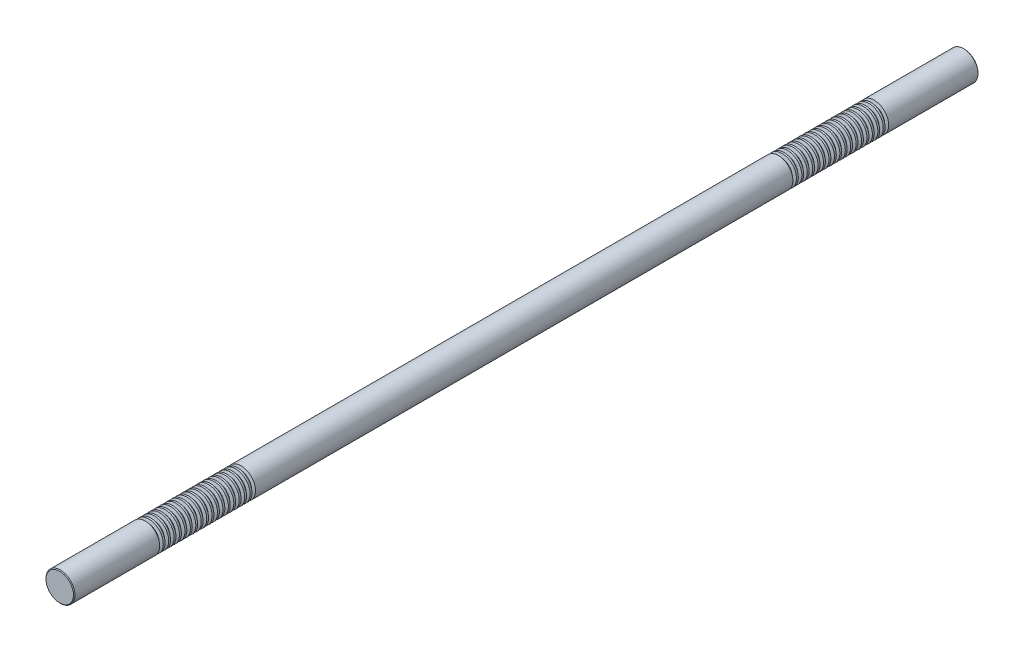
from build123d import *

# Parameters (mm, degrees)
SKETCH1_R           = 16
BOSS_EXTRUDE1_DEPTH = 500
CHAMFER1_SIZE       = 0.8
LPATTERN1_COUNT     = 18
LPATTERN1_PITCH     = 6
LPATTERN2_COUNT     = 2
LPATTERN2_PITCH     = 700


with BuildPart() as part:
    # Sketch1 → Boss-Extrude1 (new, symmetric)
    with BuildSketch(Plane.XY):
        Circle(SKETCH1_R)
    extrude(amount=BOSS_EXTRUDE1_DEPTH, both=True)

    # Chamfer1
    chamfer1_edges = [part.edges().sort_by_distance(p)[0] for p in [
        (-16, 0, -500),
        (-16, 0, 500),
    ]]
    chamfer(chamfer1_edges, length=CHAMFER1_SIZE)

    # Sketch2 → Cut-Revolve1 (revolve, cut)
    with BuildSketch(Plane(origin=(0, 0, 0), x_dir=(0, 0, -1), z_dir=(1, 0, 0)), mode=Mode.PRIVATE) as cut_revolve1_sk:
        Polygon((400.468911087, 16), (396.531088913, 16), (397.468911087, 12.5), (399.531088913, 12.5), align=None)
    cut_revolve1 = revolve(cut_revolve1_sk.sketch.rotate(Axis((0, 0, 500), (0, 0, -1)), 90), axis=Axis((0, 0, 500), (0, 0, -1)), mode=Mode.SUBTRACT)

    # LPattern1: Cut-Revolve1 ×18
    with Locations(*[(0, 0, i * LPATTERN1_PITCH) for i in range(1, LPATTERN1_COUNT)]):
        add(cut_revolve1, mode=Mode.SUBTRACT)

    # LPattern2: Cut-Revolve1 ×2
    with Locations(*[(0, 0, i * LPATTERN2_PITCH) for i in range(1, LPATTERN2_COUNT)]):
        add(cut_revolve1, mode=Mode.SUBTRACT)

    # LPattern2 copy 1 sketch → LPattern2 copy 1 (revolve, cut)
    with BuildSketch(Plane(origin=(0, 0, 706), x_dir=(0, 0, -1), z_dir=(1, 0, 0))):
        Polygon((400.468911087, 16), (396.531088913, 16), (397.468911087, 12.5), (399.531088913, 12.5), align=None)
    revolve(axis=Axis((0, 0, 1206), (0, 0, -1)), mode=Mode.SUBTRACT)

    # LPattern2 copy 2 sketch → LPattern2 copy 2 (revolve, cut)
    with BuildSketch(Plane(origin=(0, 0, 712), x_dir=(0, 0, -1), z_dir=(1, 0, 0))):
        Polygon((400.468911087, 16), (396.531088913, 16), (397.468911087, 12.5), (399.531088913, 12.5), align=None)
    revolve(axis=Axis((0, 0, 1212), (0, 0, -1)), mode=Mode.SUBTRACT)

    # LPattern2 copy 3 sketch → LPattern2 copy 3 (revolve, cut)
    with BuildSketch(Plane(origin=(0, 0, 718), x_dir=(0, 0, -1), z_dir=(1, 0, 0))):
        Polygon((400.468911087, 16), (396.531088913, 16), (397.468911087, 12.5), (399.531088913, 12.5), align=None)
    revolve(axis=Axis((0, 0, 1218), (0, 0, -1)), mode=Mode.SUBTRACT)

    # LPattern2 copy 4 sketch → LPattern2 copy 4 (revolve, cut)
    with BuildSketch(Plane(origin=(0, 0, 724), x_dir=(0, 0, -1), z_dir=(1, 0, 0))):
        Polygon((400.468911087, 16), (396.531088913, 16), (397.468911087, 12.5), (399.531088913, 12.5), align=None)
    revolve(axis=Axis((0, 0, 1224), (0, 0, -1)), mode=Mode.SUBTRACT)

    # LPattern2 copy 5 sketch → LPattern2 copy 5 (revolve, cut)
    with BuildSketch(Plane(origin=(0, 0, 730), x_dir=(0, 0, -1), z_dir=(1, 0, 0))):
        Polygon((400.468911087, 16), (396.531088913, 16), (397.468911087, 12.5), (399.531088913, 12.5), align=None)
    revolve(axis=Axis((0, 0, 1230), (0, 0, -1)), mode=Mode.SUBTRACT)

    # LPattern2 copy 6 sketch → LPattern2 copy 6 (revolve, cut)
    with BuildSketch(Plane(origin=(0, 0, 736), x_dir=(0, 0, -1), z_dir=(1, 0, 0))):
        Polygon((400.468911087, 16), (396.531088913, 16), (397.468911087, 12.5), (399.531088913, 12.5), align=None)
    revolve(axis=Axis((0, 0, 1236), (0, 0, -1)), mode=Mode.SUBTRACT)

    # LPattern2 copy 7 sketch → LPattern2 copy 7 (revolve, cut)
    with BuildSketch(Plane(origin=(0, 0, 742), x_dir=(0, 0, -1), z_dir=(1, 0, 0))):
        Polygon((400.468911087, 16), (396.531088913, 16), (397.468911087, 12.5), (399.531088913, 12.5), align=None)
    revolve(axis=Axis((0, 0, 1242), (0, 0, -1)), mode=Mode.SUBTRACT)

    # LPattern2 copy 8 sketch → LPattern2 copy 8 (revolve, cut)
    with BuildSketch(Plane(origin=(0, 0, 748), x_dir=(0, 0, -1), z_dir=(1, 0, 0))):
        Polygon((400.468911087, 16), (396.531088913, 16), (397.468911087, 12.5), (399.531088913, 12.5), align=None)
    revolve(axis=Axis((0, 0, 1248), (0, 0, -1)), mode=Mode.SUBTRACT)

    # LPattern2 copy 9 sketch → LPattern2 copy 9 (revolve, cut)
    with BuildSketch(Plane(origin=(0, 0, 754), x_dir=(0, 0, -1), z_dir=(1, 0, 0))):
        Polygon((400.468911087, 16), (396.531088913, 16), (397.468911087, 12.5), (399.531088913, 12.5), align=None)
    revolve(axis=Axis((0, 0, 1254), (0, 0, -1)), mode=Mode.SUBTRACT)

    # LPattern2 copy 10 sketch → LPattern2 copy 10 (revolve, cut)
    with BuildSketch(Plane(origin=(0, 0, 760), x_dir=(0, 0, -1), z_dir=(1, 0, 0))):
        Polygon((400.468911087, 16), (396.531088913, 16), (397.468911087, 12.5), (399.531088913, 12.5), align=None)
    revolve(axis=Axis((0, 0, 1260), (0, 0, -1)), mode=Mode.SUBTRACT)

    # LPattern2 copy 11 sketch → LPattern2 copy 11 (revolve, cut)
    with BuildSketch(Plane(origin=(0, 0, 766), x_dir=(0, 0, -1), z_dir=(1, 0, 0))):
        Polygon((400.468911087, 16), (396.531088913, 16), (397.468911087, 12.5), (399.531088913, 12.5), align=None)
    revolve(axis=Axis((0, 0, 1266), (0, 0, -1)), mode=Mode.SUBTRACT)

    # LPattern2 copy 12 sketch → LPattern2 copy 12 (revolve, cut)
    with BuildSketch(Plane(origin=(0, 0, 772), x_dir=(0, 0, -1), z_dir=(1, 0, 0))):
        Polygon((400.468911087, 16), (396.531088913, 16), (397.468911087, 12.5), (399.531088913, 12.5), align=None)
    revolve(axis=Axis((0, 0, 1272), (0, 0, -1)), mode=Mode.SUBTRACT)

    # LPattern2 copy 13 sketch → LPattern2 copy 13 (revolve, cut)
    with BuildSketch(Plane(origin=(0, 0, 778), x_dir=(0, 0, -1), z_dir=(1, 0, 0))):
        Polygon((400.468911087, 16), (396.531088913, 16), (397.468911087, 12.5), (399.531088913, 12.5), align=None)
    revolve(axis=Axis((0, 0, 1278), (0, 0, -1)), mode=Mode.SUBTRACT)

    # LPattern2 copy 14 sketch → LPattern2 copy 14 (revolve, cut)
    with BuildSketch(Plane(origin=(0, 0, 784), x_dir=(0, 0, -1), z_dir=(1, 0, 0))):
        Polygon((400.468911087, 16), (396.531088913, 16), (397.468911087, 12.5), (399.531088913, 12.5), align=None)
    revolve(axis=Axis((0, 0, 1284), (0, 0, -1)), mode=Mode.SUBTRACT)

    # LPattern2 copy 15 sketch → LPattern2 copy 15 (revolve, cut)
    with BuildSketch(Plane(origin=(0, 0, 790), x_dir=(0, 0, -1), z_dir=(1, 0, 0))):
        Polygon((400.468911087, 16), (396.531088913, 16), (397.468911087, 12.5), (399.531088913, 12.5), align=None)
    revolve(axis=Axis((0, 0, 1290), (0, 0, -1)), mode=Mode.SUBTRACT)

    # LPattern2 copy 16 sketch → LPattern2 copy 16 (revolve, cut)
    with BuildSketch(Plane(origin=(0, 0, 796), x_dir=(0, 0, -1), z_dir=(1, 0, 0))):
        Polygon((400.468911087, 16), (396.531088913, 16), (397.468911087, 12.5), (399.531088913, 12.5), align=None)
    revolve(axis=Axis((0, 0, 1296), (0, 0, -1)), mode=Mode.SUBTRACT)

    # LPattern2 copy 17 sketch → LPattern2 copy 17 (revolve, cut)
    with BuildSketch(Plane(origin=(0, 0, 802), x_dir=(0, 0, -1), z_dir=(1, 0, 0))):
        Polygon((400.468911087, 16), (396.531088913, 16), (397.468911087, 12.5), (399.531088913, 12.5), align=None)
    revolve(axis=Axis((0, 0, 1302), (0, 0, -1)), mode=Mode.SUBTRACT)


solid = part.part
